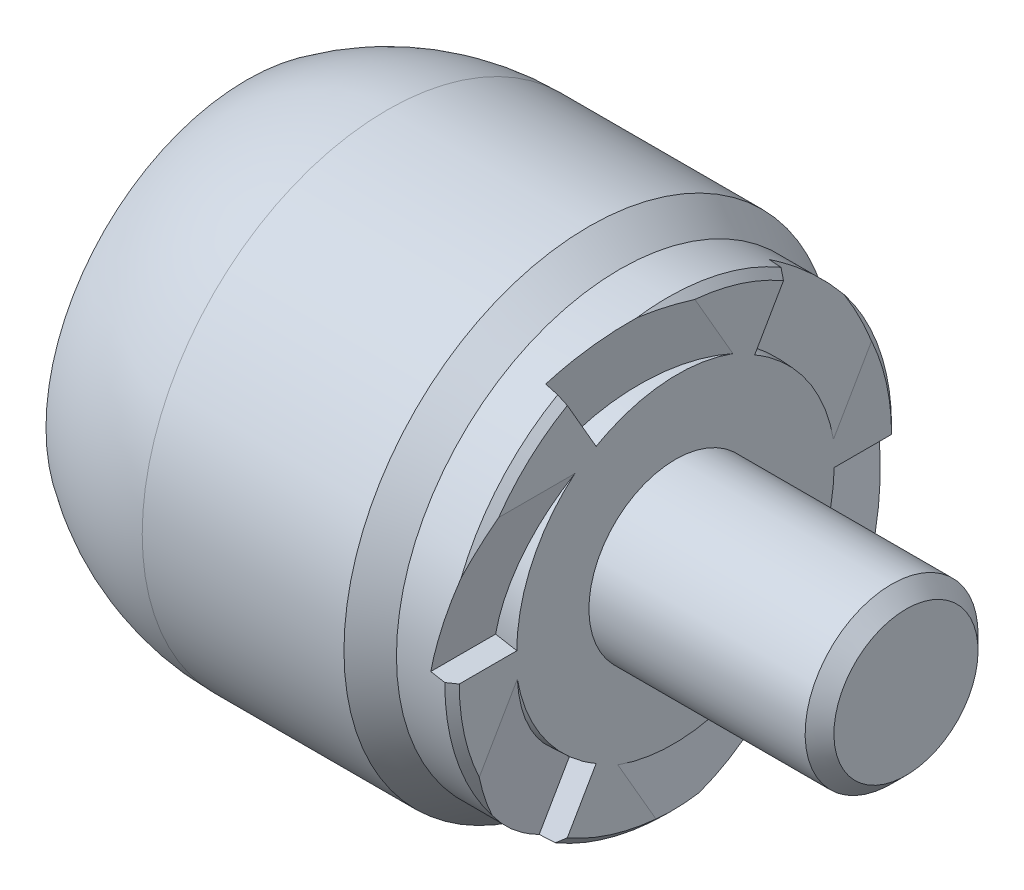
ISO-10303-21;
HEADER;
FILE_DESCRIPTION(('STEP AP214'),'2;1');
FILE_NAME('part.step','',(''),(''),'','','');
FILE_SCHEMA(('AUTOMOTIVE_DESIGN { 1 0 10303 214 1 1 1 1 }'));
ENDSEC;
DATA;
#1=APPLICATION_CONTEXT('core data for automotive mechanical design processes');
#2=APPLICATION_PROTOCOL_DEFINITION('international standard','automotive_design',2000,#1);
#3=PRODUCT_CONTEXT('',#1,'mechanical');
#4=PRODUCT('Part','Part','',(#3));
#5=PRODUCT_RELATED_PRODUCT_CATEGORY('part','',(#4));
#6=PRODUCT_DEFINITION_FORMATION('','',#4);
#7=PRODUCT_DEFINITION_CONTEXT('part definition',#1,'design');
#8=PRODUCT_DEFINITION('design','',#6,#7);
#9=PRODUCT_DEFINITION_SHAPE('','',#8);
#10=(LENGTH_UNIT() NAMED_UNIT(*) SI_UNIT(.MILLI.,.METRE.));
#11=(NAMED_UNIT(*) PLANE_ANGLE_UNIT() SI_UNIT($,.RADIAN.));
#12=(NAMED_UNIT(*) SI_UNIT($,.STERADIAN.) SOLID_ANGLE_UNIT());
#13=UNCERTAINTY_MEASURE_WITH_UNIT(LENGTH_MEASURE(1.E-05),#10,'distance_accuracy_value','');
#14=(GEOMETRIC_REPRESENTATION_CONTEXT(3) GLOBAL_UNCERTAINTY_ASSIGNED_CONTEXT((#13)) GLOBAL_UNIT_ASSIGNED_CONTEXT((#10,
#11,#12)) REPRESENTATION_CONTEXT('',''));
#15=CARTESIAN_POINT('',(0.,0.,0.));
#16=DIRECTION('',(0.,0.,1.));
#17=DIRECTION('',(1.,0.,0.));
#18=AXIS2_PLACEMENT_3D('',#15,#16,#17);
#19=CARTESIAN_POINT('',(20.,15.,0.));
#20=DIRECTION('',(1.,0.,0.));
#21=DIRECTION('',(0.,1.,0.));
#22=AXIS2_PLACEMENT_3D('',#19,#20,#21);
#23=PLANE('',#22);
#24=CARTESIAN_POINT('',(20.,0.,0.));
#25=DIRECTION('',(1.,0.,0.));
#26=DIRECTION('',(0.,1.,0.));
#27=AXIS2_PLACEMENT_3D('',#24,#25,#26);
#28=CIRCLE('',#27,6.);
#29=CARTESIAN_POINT('',(20.,5.99999999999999,0.));
#30=VERTEX_POINT('',#29);
#31=EDGE_CURVE('E384',#30,#30,#28,.T.);
#32=ORIENTED_EDGE('',*,*,#31,.F.);
#33=EDGE_LOOP('',(#32));
#34=FACE_BOUND('',#33,.T.);
#35=CARTESIAN_POINT('',(20.,0.,0.));
#36=DIRECTION('',(1.,0.,0.));
#37=DIRECTION('',(0.,1.,0.));
#38=AXIS2_PLACEMENT_3D('',#35,#36,#37);
#39=CIRCLE('',#38,15.);
#40=CARTESIAN_POINT('',(20.,0.,15.));
#41=VERTEX_POINT('',#40);
#42=CARTESIAN_POINT('',(20.,-6.30103038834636,13.6123846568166));
#43=VERTEX_POINT('',#42);
#44=EDGE_CURVE('E381',#41,#43,#39,.T.);
#45=ORIENTED_EDGE('',*,*,#44,.T.);
#46=DIRECTION('',(0.,0.866025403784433,-0.50000000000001));
#47=VECTOR('',#46,1.);
#48=CARTESIAN_POINT('',(20.,15.5690778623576,0.985671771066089));
#49=LINE('',#48,#47);
#50=CARTESIAN_POINT('',(20.,-1.72030946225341,10.9677041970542));
#51=VERTEX_POINT('',#50);
#52=EDGE_CURVE('E216',#43,#51,#49,.T.);
#53=ORIENTED_EDGE('',*,*,#52,.T.);
#54=CARTESIAN_POINT('',(20.,0.,0.));
#55=DIRECTION('',(1.,0.,0.));
#56=DIRECTION('',(0.,-0.50000000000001,-0.866025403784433));
#57=AXIS2_PLACEMENT_3D('',#54,#55,#56);
#58=ELLIPSE('',#57,11.1696927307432,11.);
#59=CARTESIAN_POINT('',(20.,-9.52627944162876,5.50000000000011));
#60=VERTEX_POINT('',#59);
#61=EDGE_CURVE('E11',#60,#51,#58,.F.);
#62=ORIENTED_EDGE('',*,*,#61,.F.);
#63=DIRECTION('',(0.,0.866025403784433,-0.50000000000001));
#64=VECTOR('',#63,1.);
#65=CARTESIAN_POINT('',(20.,-9.52627944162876,5.50000000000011));
#66=LINE('',#65,#64);
#67=CARTESIAN_POINT('',(20.,-12.9903810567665,7.50000000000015));
#68=VERTEX_POINT('',#67);
#69=EDGE_CURVE('E207',#68,#60,#66,.T.);
#70=ORIENTED_EDGE('',*,*,#69,.F.);
#71=CARTESIAN_POINT('',(20.,-14.9391861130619,1.34933994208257));
#72=VERTEX_POINT('',#71);
#73=EDGE_CURVE('E385',#68,#72,#39,.T.);
#74=ORIENTED_EDGE('',*,*,#73,.T.);
#75=DIRECTION('',(0.,0.866025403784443,0.499999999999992));
#76=VECTOR('',#75,1.);
#77=CARTESIAN_POINT('',(20.,6.93092213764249,13.9760528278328));
#78=LINE('',#77,#76);
#79=CARTESIAN_POINT('',(20.,-10.3584651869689,3.9940204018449));
#80=VERTEX_POINT('',#79);
#81=EDGE_CURVE('E258',#72,#80,#78,.T.);
#82=ORIENTED_EDGE('',*,*,#81,.T.);
#83=CARTESIAN_POINT('',(20.,0.,0.));
#84=DIRECTION('',(1.,0.,0.));
#85=DIRECTION('',(0.,0.499999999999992,-0.866025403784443));
#86=AXIS2_PLACEMENT_3D('',#83,#84,#85);
#87=ELLIPSE('',#86,11.1696927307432,11.);
#88=CARTESIAN_POINT('',(20.,-9.52627944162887,-5.49999999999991));
#89=VERTEX_POINT('',#88);
#90=EDGE_CURVE('E439',#89,#80,#87,.F.);
#91=ORIENTED_EDGE('',*,*,#90,.F.);
#92=DIRECTION('',(0.,0.866025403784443,0.499999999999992));
#93=VECTOR('',#92,1.);
#94=CARTESIAN_POINT('',(20.,-9.52627944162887,-5.49999999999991));
#95=LINE('',#94,#93);
#96=CARTESIAN_POINT('',(20.,-12.9903810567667,-7.49999999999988));
#97=VERTEX_POINT('',#96);
#98=EDGE_CURVE('E591',#97,#89,#95,.T.);
#99=ORIENTED_EDGE('',*,*,#98,.F.);
#100=CARTESIAN_POINT('',(20.,-8.63815572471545,-12.263044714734));
#101=VERTEX_POINT('',#100);
#102=EDGE_CURVE('E576',#97,#101,#39,.T.);
#103=ORIENTED_EDGE('',*,*,#102,.T.);
#104=DIRECTION('',(0.,0.,1.));
#105=VECTOR('',#104,1.);
#106=CARTESIAN_POINT('',(20.,-8.6381557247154,1.65064454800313E-13));
#107=LINE('',#106,#105);
#108=CARTESIAN_POINT('',(20.,-8.63815572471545,-6.97368379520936));
#109=VERTEX_POINT('',#108);
#110=EDGE_CURVE('E272',#101,#109,#107,.T.);
#111=ORIENTED_EDGE('',*,*,#110,.T.);
#112=CARTESIAN_POINT('',(20.,0.,0.));
#113=DIRECTION('',(1.,0.,0.));
#114=DIRECTION('',(0.,1.,0.));
#115=AXIS2_PLACEMENT_3D('',#112,#113,#114);
#116=ELLIPSE('',#115,11.1696927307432,11.);
#117=CARTESIAN_POINT('',(20.,0.,-11.));
#118=VERTEX_POINT('',#117);
#119=EDGE_CURVE('E432',#118,#109,#116,.F.);
#120=ORIENTED_EDGE('',*,*,#119,.F.);
#121=DIRECTION('',(0.,0.,1.));
#122=VECTOR('',#121,1.);
#123=CARTESIAN_POINT('',(20.,0.,-11.));
#124=LINE('',#123,#122);
#125=CARTESIAN_POINT('',(20.,-1.00889892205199E-13,-15.));
#126=VERTEX_POINT('',#125);
#127=EDGE_CURVE('E263',#126,#118,#124,.T.);
#128=ORIENTED_EDGE('',*,*,#127,.F.);
#129=CARTESIAN_POINT('',(20.,6.30103038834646,-13.6123846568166));
#130=VERTEX_POINT('',#129);
#131=EDGE_CURVE('E575',#126,#130,#39,.T.);
#132=ORIENTED_EDGE('',*,*,#131,.T.);
#133=DIRECTION('',(0.,-0.866025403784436,0.500000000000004));
#134=VECTOR('',#133,1.);
#135=CARTESIAN_POINT('',(20.,6.93092213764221,-13.9760528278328));
#136=LINE('',#135,#134);
#137=CARTESIAN_POINT('',(20.,1.72030946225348,-10.9677041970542));
#138=VERTEX_POINT('',#137);
#139=EDGE_CURVE('E313',#130,#138,#136,.T.);
#140=ORIENTED_EDGE('',*,*,#139,.T.);
#141=CARTESIAN_POINT('',(20.,0.,0.));
#142=DIRECTION('',(1.,0.,0.));
#143=DIRECTION('',(0.,0.500000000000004,0.866025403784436));
#144=AXIS2_PLACEMENT_3D('',#141,#142,#143);
#145=ELLIPSE('',#144,11.1696927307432,11.);
#146=CARTESIAN_POINT('',(20.,9.5262794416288,-5.50000000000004));
#147=VERTEX_POINT('',#146);
#148=EDGE_CURVE('E425',#147,#138,#145,.F.);
#149=ORIENTED_EDGE('',*,*,#148,.F.);
#150=DIRECTION('',(0.,-0.866025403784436,0.500000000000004));
#151=VECTOR('',#150,1.);
#152=CARTESIAN_POINT('',(20.,9.5262794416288,-5.50000000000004));
#153=LINE('',#152,#151);
#154=CARTESIAN_POINT('',(20.,12.9903810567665,-7.50000000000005));
#155=VERTEX_POINT('',#154);
#156=EDGE_CURVE('E574',#155,#147,#153,.T.);
#157=ORIENTED_EDGE('',*,*,#156,.F.);
#158=CARTESIAN_POINT('',(20.,14.9391861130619,-1.34933994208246));
#159=VERTEX_POINT('',#158);
#160=EDGE_CURVE('E563',#155,#159,#39,.T.);
#161=ORIENTED_EDGE('',*,*,#160,.T.);
#162=DIRECTION('',(0.,-0.86602540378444,-0.499999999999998));
#163=VECTOR('',#162,1.);
#164=CARTESIAN_POINT('',(20.,15.5690778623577,-0.985671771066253));
#165=LINE('',#164,#163);
#166=CARTESIAN_POINT('',(20.,10.3584651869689,-3.99402040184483));
#167=VERTEX_POINT('',#166);
#168=EDGE_CURVE('E327',#159,#167,#165,.T.);
#169=ORIENTED_EDGE('',*,*,#168,.T.);
#170=CARTESIAN_POINT('',(20.,0.,0.));
#171=DIRECTION('',(1.,0.,0.));
#172=DIRECTION('',(0.,-0.499999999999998,0.86602540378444));
#173=AXIS2_PLACEMENT_3D('',#170,#171,#172);
#174=ELLIPSE('',#173,11.1696927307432,11.);
#175=CARTESIAN_POINT('',(20.,9.52627944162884,5.49999999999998));
#176=VERTEX_POINT('',#175);
#177=EDGE_CURVE('E418',#176,#167,#174,.F.);
#178=ORIENTED_EDGE('',*,*,#177,.F.);
#179=DIRECTION('',(0.,-0.86602540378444,-0.499999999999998));
#180=VECTOR('',#179,1.);
#181=CARTESIAN_POINT('',(20.,9.52627944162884,5.49999999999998));
#182=LINE('',#181,#180);
#183=CARTESIAN_POINT('',(20.,12.9903810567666,7.49999999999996));
#184=VERTEX_POINT('',#183);
#185=EDGE_CURVE('E312',#184,#176,#182,.T.);
#186=ORIENTED_EDGE('',*,*,#185,.F.);
#187=CARTESIAN_POINT('',(20.,8.63815572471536,12.2630447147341));
#188=VERTEX_POINT('',#187);
#189=EDGE_CURVE('E380',#184,#188,#39,.T.);
#190=ORIENTED_EDGE('',*,*,#189,.T.);
#191=DIRECTION('',(0.,0.,-1.));
#192=VECTOR('',#191,1.);
#193=CARTESIAN_POINT('',(20.,8.6381557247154,0.));
#194=LINE('',#193,#192);
#195=CARTESIAN_POINT('',(20.,8.63815572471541,6.97368379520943));
#196=VERTEX_POINT('',#195);
#197=EDGE_CURVE('E366',#188,#196,#194,.T.);
#198=ORIENTED_EDGE('',*,*,#197,.T.);
#199=CARTESIAN_POINT('',(20.,0.,0.));
#200=DIRECTION('',(1.,0.,0.));
#201=DIRECTION('',(0.,-1.,0.));
#202=AXIS2_PLACEMENT_3D('',#199,#200,#201);
#203=ELLIPSE('',#202,11.1696927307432,11.);
#204=CARTESIAN_POINT('',(20.,0.,11.));
#205=VERTEX_POINT('',#204);
#206=EDGE_CURVE('E411',#205,#196,#203,.F.);
#207=ORIENTED_EDGE('',*,*,#206,.F.);
#208=DIRECTION('',(0.,0.,-1.));
#209=VECTOR('',#208,1.);
#210=CARTESIAN_POINT('',(20.,0.,11.));
#211=LINE('',#210,#209);
#212=EDGE_CURVE('E336',#41,#205,#211,.T.);
#213=ORIENTED_EDGE('',*,*,#212,.F.);
#214=EDGE_LOOP('',(#45,#53,#62,#70,#74,#82,#91,#99,#103,#111,#120,#128,#132,#140,#149,#157,#161,
#169,#178,#186,#190,#198,#207,#213));
#215=FACE_BOUND('',#214,.T.);
#216=ADVANCED_FACE('F29',(#34,#215),#23,.T.);
#217=CARTESIAN_POINT('',(20.,0.,0.));
#218=DIRECTION('',(-1.,0.,0.));
#219=DIRECTION('',(0.,-1.,0.));
#220=AXIS2_PLACEMENT_3D('',#217,#218,#219);
#221=CONICAL_SURFACE('',#220,15.,0.785398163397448);
#222=CARTESIAN_POINT('',(19.5,0.,0.));
#223=DIRECTION('',(1.,0.,0.));
#224=DIRECTION('',(0.,1.,0.));
#225=AXIS2_PLACEMENT_3D('',#222,#223,#224);
#226=CIRCLE('',#225,15.5);
#227=CARTESIAN_POINT('',(19.5,0.0881634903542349,15.4997492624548));
#228=VERTEX_POINT('',#227);
#229=CARTESIAN_POINT('',(19.5,-9.54605621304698,12.2115851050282));
#230=VERTEX_POINT('',#229);
#231=EDGE_CURVE('E377',#228,#230,#226,.T.);
#232=ORIENTED_EDGE('',*,*,#231,.T.);
#233=CARTESIAN_POINT('',(17.9466509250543,-1.50348277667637,-2.60410855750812));
#234=DIRECTION('',(0.984807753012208,-0.086824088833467,-0.150383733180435));
#235=DIRECTION('',(-0.173648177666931,-0.492403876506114,-0.852868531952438));
#236=AXIS2_PLACEMENT_3D('',#233,#234,#235);
#237=ELLIPSE('',#236,17.316424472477,16.7861512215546);
#238=EDGE_CURVE('E44',#230,#43,#237,.F.);
#239=ORIENTED_EDGE('',*,*,#238,.T.);
#240=ORIENTED_EDGE('',*,*,#44,.F.);
#241=CARTESIAN_POINT('',(19.4998,0.0881987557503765,15.499949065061));
#242=CARTESIAN_POINT('',(19.5832202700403,0.0734895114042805,15.4166117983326));
#243=CARTESIAN_POINT('',(19.6666304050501,0.0587820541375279,15.3332640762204));
#244=CARTESIAN_POINT('',(19.8334304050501,0.0293707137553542,15.1665477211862));
#245=CARTESIAN_POINT('',(19.9168202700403,0.0146668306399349,15.0831790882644));
#246=CARTESIAN_POINT('',(20.0002,-3.52653961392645E-05,14.9997999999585));
#247=B_SPLINE_CURVE_WITH_KNOTS('',3,(#241,#242,#243,#244,#245,#246),.UNSPECIFIED.,.F.,.F.,(4,2,
4),(0.,0.356487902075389,0.712975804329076),.UNSPECIFIED.);
#248=EDGE_CURVE('E359',#228,#41,#247,.T.);
#249=ORIENTED_EDGE('',*,*,#248,.F.);
#250=EDGE_LOOP('',(#232,#239,#240,#249));
#251=FACE_BOUND('',#250,.T.);
#252=ADVANCED_FACE('F484',(#251),#221,.T.);
#253=CARTESIAN_POINT('',(15.0433821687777,-16.8293635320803,10.72562904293));
#254=CARTESIAN_POINT('',(15.4152123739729,-16.5423096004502,10.4841919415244));
#255=CARTESIAN_POINT('',(15.7869540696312,-16.2551683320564,10.2427224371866));
#256=CARTESIAN_POINT('',(16.530223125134,-15.6806741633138,9.75970488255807));
#257=CARTESIAN_POINT('',(16.9017504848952,-15.3933212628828,9.51815683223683));
#258=CARTESIAN_POINT('',(18.0159544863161,-14.5308901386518,8.79337464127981));
#259=CARTESIAN_POINT('',(18.7582532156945,-13.9554393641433,8.31000235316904));
#260=CARTESIAN_POINT('',(19.6666396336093,-13.2496142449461,7.71754214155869));
#261=CARTESIAN_POINT('',(19.833441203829,-13.1199408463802,7.60871355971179));
#262=CARTESIAN_POINT('',(20.0431105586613,-12.9568469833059,7.47186157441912));
#263=CARTESIAN_POINT('',(20.0860182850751,-12.9234657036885,7.44385266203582));
#264=CARTESIAN_POINT('',(20.5518805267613,-12.5609801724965,7.13971972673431));
#265=CARTESIAN_POINT('',(20.9745590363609,-12.2316050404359,6.86349550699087));
#266=CARTESIAN_POINT('',(21.8191891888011,-11.5721441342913,6.31078477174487));
#267=CARTESIAN_POINT('',(22.2411408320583,-11.242058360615,6.03429825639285));
#268=CARTESIAN_POINT('',(23.0840784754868,-10.5809403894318,5.48097541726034));
#269=CARTESIAN_POINT('',(23.5050644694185,-10.2499081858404,5.20413909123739));
#270=CARTESIAN_POINT('',(24.1355400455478,-9.75238554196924,4.78852636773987));
#271=CARTESIAN_POINT('',(24.345531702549,-9.58638197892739,4.64992884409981));
#272=CARTESIAN_POINT('',(24.7651110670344,-9.25398404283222,4.372590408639));
#273=CARTESIAN_POINT('',(24.9746987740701,-9.08758966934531,4.23384949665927));
#274=CARTESIAN_POINT('',(25.1840496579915,-8.92096696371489,4.09502497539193));
#275=B_SPLINE_CURVE_WITH_KNOTS('',3,(#253,#254,#255,#256,#257,#258,#259,#260,#261,#262,#263,
#264,#265,#266,#267,#268,#269,#270,#271,#272,#273,#274),.UNSPECIFIED.,.F.,.F.,(4,2,2,2,2,2,2,2,
2,2,4),(0.,1.58447010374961,3.1689408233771,6.33788155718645,7.05085735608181,7.23432108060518,
9.04291206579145,10.8515020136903,12.6601036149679,13.5644075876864,14.4687125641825),.UNSPECIFIED.);
#276=CARTESIAN_POINT('',(19.5,-13.3790948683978,7.82622645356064));
#277=VERTEX_POINT('',#276);
#278=EDGE_CURVE('E218',#277,#68,#275,.T.);
#279=ORIENTED_EDGE('',*,*,#278,.F.);
#280=CARTESIAN_POINT('',(19.5,-15.3485710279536,-2.16133463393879));
#281=VERTEX_POINT('',#280);
#282=EDGE_CURVE('E52',#277,#281,#226,.T.);
#283=ORIENTED_EDGE('',*,*,#282,.T.);
#284=CARTESIAN_POINT('',(17.9466509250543,1.5034827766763,-2.60410855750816));
#285=DIRECTION('',(0.984807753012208,0.0868240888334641,-0.150383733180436));
#286=DIRECTION('',(-0.173648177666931,0.492403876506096,-0.852868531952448));
#287=AXIS2_PLACEMENT_3D('',#284,#285,#286);
#288=ELLIPSE('',#287,17.316424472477,16.7861512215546);
#289=EDGE_CURVE('E589',#281,#72,#288,.F.);
#290=ORIENTED_EDGE('',*,*,#289,.T.);
#291=ORIENTED_EDGE('',*,*,#73,.F.);
#292=EDGE_LOOP('',(#279,#283,#290,#291));
#293=FACE_BOUND('',#292,.T.);
#294=ADVANCED_FACE('F443',(#293),#221,.T.);
#295=CARTESIAN_POINT('',(19.4998,-13.4674490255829,-7.67359216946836));
#296=CARTESIAN_POINT('',(19.5832202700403,-13.3879222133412,-7.64466211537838));
#297=CARTESIAN_POINT('',(19.6666304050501,-13.308387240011,-7.61572528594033));
#298=CARTESIAN_POINT('',(19.8334304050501,-13.149300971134,-7.55783807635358));
#299=CARTESIAN_POINT('',(19.9168202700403,-13.0697496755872,-7.52888769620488));
#300=CARTESIAN_POINT('',(20.0002,-12.9901902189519,-7.4999305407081));
#301=B_SPLINE_CURVE_WITH_KNOTS('',3,(#295,#296,#297,#298,#299,#300),.UNSPECIFIED.,.F.,.F.,(4,2,
4),(0.,0.356487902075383,0.712975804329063),.UNSPECIFIED.);
#302=CARTESIAN_POINT('',(19.5,-13.4672583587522,-7.67352280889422));
#303=VERTEX_POINT('',#302);
#304=EDGE_CURVE('E251',#303,#97,#301,.T.);
#305=ORIENTED_EDGE('',*,*,#304,.F.);
#306=CARTESIAN_POINT('',(19.5,-5.80251481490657,-14.3729197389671));
#307=VERTEX_POINT('',#306);
#308=EDGE_CURVE('E447',#303,#307,#226,.T.);
#309=ORIENTED_EDGE('',*,*,#308,.T.);
#310=CARTESIAN_POINT('',(17.9466509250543,3.00696555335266,0.));
#311=DIRECTION('',(0.984807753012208,0.173648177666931,0.));
#312=DIRECTION('',(-0.173648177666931,0.984807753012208,0.));
#313=AXIS2_PLACEMENT_3D('',#310,#311,#312);
#314=ELLIPSE('',#313,17.316424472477,16.7861512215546);
#315=EDGE_CURVE('E269',#307,#101,#314,.F.);
#316=ORIENTED_EDGE('',*,*,#315,.T.);
#317=ORIENTED_EDGE('',*,*,#102,.F.);
#318=EDGE_LOOP('',(#305,#309,#316,#317));
#319=FACE_BOUND('',#318,.T.);
#320=ADVANCED_FACE('F561',(#319),#221,.T.);
#321=CARTESIAN_POINT('',(19.4998,-0.08819875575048,-15.499949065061));
#322=CARTESIAN_POINT('',(19.5832202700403,-0.0734895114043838,-15.4166117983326));
#323=CARTESIAN_POINT('',(19.6666304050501,-0.0587820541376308,-15.3332640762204));
#324=CARTESIAN_POINT('',(19.8334304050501,-0.0293707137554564,-15.1665477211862));
#325=CARTESIAN_POINT('',(19.9168202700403,-0.0146668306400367,-15.0831790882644));
#326=CARTESIAN_POINT('',(20.0002,3.5265396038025E-05,-14.9997999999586));
#327=B_SPLINE_CURVE_WITH_KNOTS('',3,(#321,#322,#323,#324,#325,#326),.UNSPECIFIED.,.F.,.F.,(4,2,
4),(0.,0.356487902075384,0.712975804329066),.UNSPECIFIED.);
#328=CARTESIAN_POINT('',(19.5,-0.0881634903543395,-15.4997492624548));
#329=VERTEX_POINT('',#328);
#330=EDGE_CURVE('E275',#329,#126,#327,.T.);
#331=ORIENTED_EDGE('',*,*,#330,.F.);
#332=CARTESIAN_POINT('',(19.5,9.54605621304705,-12.2115851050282));
#333=VERTEX_POINT('',#332);
#334=EDGE_CURVE('E448',#329,#333,#226,.T.);
#335=ORIENTED_EDGE('',*,*,#334,.T.);
#336=CARTESIAN_POINT('',(17.9466509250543,1.50348277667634,2.60410855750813));
#337=DIRECTION('',(0.984807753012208,0.0868240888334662,0.150383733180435));
#338=DIRECTION('',(-0.173648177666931,0.492403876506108,0.852868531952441));
#339=AXIS2_PLACEMENT_3D('',#336,#337,#338);
#340=ELLIPSE('',#339,17.316424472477,16.7861512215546);
#341=EDGE_CURVE('E601',#333,#130,#340,.F.);
#342=ORIENTED_EDGE('',*,*,#341,.T.);
#343=ORIENTED_EDGE('',*,*,#131,.F.);
#344=EDGE_LOOP('',(#331,#335,#342,#343));
#345=FACE_BOUND('',#344,.T.);
#346=ADVANCED_FACE('F557',(#345),#221,.T.);
#347=CARTESIAN_POINT('',(15.0433822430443,16.8293634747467,-10.7256289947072));
#348=CARTESIAN_POINT('',(15.4152124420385,16.5423095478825,-10.4841918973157));
#349=CARTESIAN_POINT('',(15.786954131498,16.2551682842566,-10.2427223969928));
#350=CARTESIAN_POINT('',(16.5302231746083,15.6806741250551,-9.75970485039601));
#351=CARTESIAN_POINT('',(16.9017505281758,15.3933212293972,-9.51815680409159));
#352=CARTESIAN_POINT('',(18.0159545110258,14.5308901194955,-8.79337462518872));
#353=CARTESIAN_POINT('',(18.7582532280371,13.955439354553,-8.31000234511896));
#354=CARTESIAN_POINT('',(19.6666396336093,13.2496142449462,-7.71754214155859));
#355=CARTESIAN_POINT('',(19.833441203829,13.1199408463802,-7.60871355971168));
#356=CARTESIAN_POINT('',(20.0431105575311,12.9568469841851,-7.4718615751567));
#357=CARTESIAN_POINT('',(20.0860182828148,12.923465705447,-7.44385266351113));
#358=CARTESIAN_POINT('',(20.5518805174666,12.5609801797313,-7.13971973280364));
#359=CARTESIAN_POINT('',(20.9745590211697,12.2316050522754,-6.86349551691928));
#360=CARTESIAN_POINT('',(21.8191891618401,11.572144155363,-6.31078478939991));
#361=CARTESIAN_POINT('',(22.2411407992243,11.2420583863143,-6.03429827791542));
#362=CARTESIAN_POINT('',(23.0840784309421,10.5809404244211,-5.48097544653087));
#363=CARTESIAN_POINT('',(23.5050644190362,10.2499082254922,-5.20413912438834));
#364=CARTESIAN_POINT('',(24.135539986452,9.75238558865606,-4.78852640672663));
#365=CARTESIAN_POINT('',(24.3455316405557,9.58638202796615,-4.64992888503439));
#366=CARTESIAN_POINT('',(24.7651109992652,9.25398409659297,-4.37259045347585));
#367=CARTESIAN_POINT('',(24.9746987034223,9.08758972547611,-4.23384954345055));
#368=CARTESIAN_POINT('',(25.1840495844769,8.92096702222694,-4.09502502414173));
#369=B_SPLINE_CURVE_WITH_KNOTS('',3,(#347,#348,#349,#350,#351,#352,#353,#354,#355,#356,#357,
#358,#359,#360,#361,#362,#363,#364,#365,#366,#367,#368),.UNSPECIFIED.,.F.,.F.,(4,2,2,2,2,2,2,2,
2,2,4),(0.,1.58447007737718,3.16894077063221,6.33788145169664,7.05085725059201,7.23432097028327,
9.04291193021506,10.8515018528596,12.660103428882,13.5644073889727,14.468712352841),.UNSPECIFIED.);
#370=CARTESIAN_POINT('',(19.5,13.3790948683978,-7.82622645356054));
#371=VERTEX_POINT('',#370);
#372=EDGE_CURVE('E306',#371,#155,#369,.T.);
#373=ORIENTED_EDGE('',*,*,#372,.F.);
#374=CARTESIAN_POINT('',(19.5,15.3485710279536,2.16133463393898));
#375=VERTEX_POINT('',#374);
#376=EDGE_CURVE('E453',#371,#375,#226,.T.);
#377=ORIENTED_EDGE('',*,*,#376,.T.);
#378=CARTESIAN_POINT('',(17.9466509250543,-1.50348277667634,2.60410855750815));
#379=DIRECTION('',(0.984807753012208,-0.0868240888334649,0.150383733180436));
#380=DIRECTION('',(-0.173648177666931,-0.492403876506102,0.852868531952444));
#381=AXIS2_PLACEMENT_3D('',#378,#379,#380);
#382=ELLIPSE('',#381,17.316424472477,16.7861512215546);
#383=EDGE_CURVE('E324',#375,#159,#382,.F.);
#384=ORIENTED_EDGE('',*,*,#383,.T.);
#385=ORIENTED_EDGE('',*,*,#160,.F.);
#386=EDGE_LOOP('',(#373,#377,#384,#385));
#387=FACE_BOUND('',#386,.T.);
#388=ADVANCED_FACE('F536',(#387),#221,.T.);
#389=CARTESIAN_POINT('',(0.,0.,0.));
#390=DIRECTION('',(1.,0.,0.));
#391=DIRECTION('',(0.,1.,0.));
#392=AXIS2_PLACEMENT_3D('',#389,#390,#391);
#393=SPHERICAL_SURFACE('',#392,17.);
#394=CARTESIAN_POINT('',(-9.75079941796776,0.,0.));
#395=DIRECTION('',(1.,0.,0.));
#396=DIRECTION('',(0.,1.,0.));
#397=AXIS2_PLACEMENT_3D('',#394,#395,#396);
#398=CIRCLE('',#397,13.9255847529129);
#399=CARTESIAN_POINT('',(-9.75079941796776,13.9255847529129,0.));
#400=VERTEX_POINT('',#399);
#401=EDGE_CURVE('E403',#400,#400,#398,.T.);
#402=ORIENTED_EDGE('',*,*,#401,.T.);
#403=EDGE_LOOP('',(#402));
#404=FACE_BOUND('',#403,.T.);
#405=CARTESIAN_POINT('',(0.,0.,0.));
#406=DIRECTION('',(1.,0.,0.));
#407=DIRECTION('',(0.,1.,0.));
#408=AXIS2_PLACEMENT_3D('',#405,#406,#407);
#409=CIRCLE('',#408,17.);
#410=CARTESIAN_POINT('',(0.,17.,0.));
#411=VERTEX_POINT('',#410);
#412=EDGE_CURVE('E365',#411,#411,#409,.T.);
#413=ORIENTED_EDGE('',*,*,#412,.F.);
#414=EDGE_LOOP('',(#413));
#415=FACE_BOUND('',#414,.T.);
#416=ADVANCED_FACE('F31',(#404,#415),#393,.T.);
#417=CARTESIAN_POINT('',(-9.75079941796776,0.,0.));
#418=DIRECTION('',(-1.,0.,0.));
#419=DIRECTION('',(0.,-1.,0.));
#420=AXIS2_PLACEMENT_3D('',#417,#418,#419);
#421=CONICAL_SURFACE('',#420,13.9255847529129,0.959931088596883);
#422=CARTESIAN_POINT('',(-6.88291723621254,0.,0.));
#423=DIRECTION('',(1.,0.,0.));
#424=DIRECTION('',(0.,1.,0.));
#425=AXIS2_PLACEMENT_3D('',#422,#423,#424);
#426=CIRCLE('',#425,9.82982453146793);
#427=CARTESIAN_POINT('',(-6.88291723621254,9.82982453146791,0.));
#428=VERTEX_POINT('',#427);
#429=EDGE_CURVE('E400',#428,#428,#426,.T.);
#430=ORIENTED_EDGE('',*,*,#429,.T.);
#431=EDGE_LOOP('',(#430));
#432=FACE_BOUND('',#431,.T.);
#433=ORIENTED_EDGE('',*,*,#401,.F.);
#434=EDGE_LOOP('',(#433));
#435=FACE_BOUND('',#434,.T.);
#436=ADVANCED_FACE('F529',(#432,#435),#421,.F.);
#437=CARTESIAN_POINT('',(0.,0.,0.));
#438=DIRECTION('',(1.,0.,0.));
#439=DIRECTION('',(0.,1.,0.));
#440=AXIS2_PLACEMENT_3D('',#437,#438,#439);
#441=SPHERICAL_SURFACE('',#440,12.);
#442=CARTESIAN_POINT('',(9.74679434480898,0.,0.));
#443=DIRECTION('',(1.,0.,0.));
#444=DIRECTION('',(0.,1.,0.));
#445=AXIS2_PLACEMENT_3D('',#442,#443,#444);
#446=CIRCLE('',#445,7.);
#447=CARTESIAN_POINT('',(9.74679434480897,6.99999999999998,0.));
#448=VERTEX_POINT('',#447);
#449=EDGE_CURVE('E397',#448,#448,#446,.T.);
#450=CARTESIAN_POINT('',(9.74679434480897,6.99999999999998,0.));
#451=CARTESIAN_POINT('',(9.63313246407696,7.1582696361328,0.));
#452=CARTESIAN_POINT('',(9.51560945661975,7.31376584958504,0.));
#453=CARTESIAN_POINT('',(9.2731339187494,7.61885355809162,0.));
#454=CARTESIAN_POINT('',(9.14818138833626,7.76844505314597,0.));
#455=CARTESIAN_POINT('',(8.89113953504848,8.06136545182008,0.));
#456=CARTESIAN_POINT('',(8.75905021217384,8.20469435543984,0.));
#457=CARTESIAN_POINT('',(8.48804915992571,8.48475031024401,0.));
#458=CARTESIAN_POINT('',(8.34913743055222,8.62147736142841,0.));
#459=CARTESIAN_POINT('',(8.06482087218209,8.88800500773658,0.));
#460=CARTESIAN_POINT('',(7.91941604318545,9.01780560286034,0.));
#461=CARTESIAN_POINT('',(7.62245833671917,9.27017243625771,0.));
#462=CARTESIAN_POINT('',(7.47090545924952,9.39273867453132,0.));
#463=CARTESIAN_POINT('',(7.16201120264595,9.63034598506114,0.));
#464=CARTESIAN_POINT('',(7.00466982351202,9.74538705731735,0.));
#465=CARTESIAN_POINT('',(6.68457186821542,9.96767109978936,0.));
#466=CARTESIAN_POINT('',(6.52181529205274,10.0749140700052,0.));
#467=CARTESIAN_POINT('',(6.19127308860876,10.281347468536,0.));
#468=CARTESIAN_POINT('',(6.02348746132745,10.380537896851,0.));
#469=CARTESIAN_POINT('',(5.68328523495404,10.5706308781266,0.));
#470=CARTESIAN_POINT('',(5.51086863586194,10.6615334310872,0.));
#471=CARTESIAN_POINT('',(5.16181353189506,10.8348349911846,0.));
#472=CARTESIAN_POINT('',(4.98517502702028,10.9172339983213,0.));
#473=CARTESIAN_POINT('',(4.6280951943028,11.073332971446,0.));
#474=CARTESIAN_POINT('',(4.4476538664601,11.1470329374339,0.));
#475=CARTESIAN_POINT('',(4.08339649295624,11.2855589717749,0.));
#476=CARTESIAN_POINT('',(3.89958044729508,11.350385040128,0.));
#477=CARTESIAN_POINT('',(3.52900974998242,11.4710094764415,0.));
#478=CARTESIAN_POINT('',(3.34225509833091,11.5268078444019,0.));
#479=CARTESIAN_POINT('',(2.96625027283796,11.6292444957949,0.));
#480=CARTESIAN_POINT('',(2.77700009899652,11.6758827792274,0.));
#481=CARTESIAN_POINT('',(2.39645323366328,11.7598886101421,0.));
#482=CARTESIAN_POINT('',(2.20515654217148,11.7972561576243,0.));
#483=CARTESIAN_POINT('',(1.82097050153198,11.8626318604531,0.));
#484=CARTESIAN_POINT('',(1.62808115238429,11.8906400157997,0.));
#485=CARTESIAN_POINT('',(1.24116743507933,11.9372304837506,0.));
#486=CARTESIAN_POINT('',(1.04714306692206,11.9558127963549,0.));
#487=CARTESIAN_POINT('',(0.658419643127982,11.9835074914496,0.));
#488=CARTESIAN_POINT('',(0.463720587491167,11.99261987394,0.));
#489=CARTESIAN_POINT('',(0.0741097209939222,12.0013530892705,0.));
#490=CARTESIAN_POINT('',(-0.120802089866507,12.0009739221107,0.));
#491=CARTESIAN_POINT('',(-0.510376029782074,11.9907249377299,0.));
#492=CARTESIAN_POINT('',(-0.705038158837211,11.980855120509,0.));
#493=CARTESIAN_POINT('',(-1.09365089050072,11.9516482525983,0.));
#494=CARTESIAN_POINT('',(-1.2876014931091,11.9323112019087,0.));
#495=CARTESIAN_POINT('',(-1.67433101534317,11.8842157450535,0.));
#496=CARTESIAN_POINT('',(-1.86710993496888,11.8554573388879,0.));
#497=CARTESIAN_POINT('',(-2.25103871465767,11.7885874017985,0.));
#498=CARTESIAN_POINT('',(-2.44218857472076,11.7504758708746,0.));
#499=CARTESIAN_POINT('',(-2.82240572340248,11.6649901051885,0.));
#500=CARTESIAN_POINT('',(-3.01147301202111,11.6176158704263,0.));
#501=CARTESIAN_POINT('',(-3.3870764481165,11.5137170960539,0.));
#502=CARTESIAN_POINT('',(-3.57361259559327,11.4571925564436,0.));
#503=CARTESIAN_POINT('',(-3.943711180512,11.3351272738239,0.));
#504=CARTESIAN_POINT('',(-4.12727361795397,11.2695865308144,0.));
#505=CARTESIAN_POINT('',(-4.49098928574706,11.1296443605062,0.));
#506=CARTESIAN_POINT('',(-4.67114251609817,11.0552429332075,0.));
#507=CARTESIAN_POINT('',(-5.02761229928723,10.8977558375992,0.));
#508=CARTESIAN_POINT('',(-5.20392885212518,10.8146701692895,0.));
#509=CARTESIAN_POINT('',(-5.552307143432,10.6400120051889,0.));
#510=CARTESIAN_POINT('',(-5.72436888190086,10.5484395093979,0.));
#511=CARTESIAN_POINT('',(-6.06382864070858,10.3570238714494,0.));
#512=CARTESIAN_POINT('',(-6.23122666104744,10.2571807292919,0.));
#513=CARTESIAN_POINT('',(-6.56096436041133,10.0494647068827,0.));
#514=CARTESIAN_POINT('',(-6.72330403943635,9.94159182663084,0.));
#515=CARTESIAN_POINT('',(-6.88291723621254,9.82982453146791,0.));
#516=B_SPLINE_CURVE_WITH_KNOTS('',3,(#450,#451,#452,#453,#454,#455,#456,#457,#458,#459,#460,
#461,#462,#463,#464,#465,#466,#467,#468,#469,#470,#471,#472,#473,#474,#475,#476,#477,#478,#479,
#480,#481,#482,#483,#484,#485,#486,#487,#488,#489,#490,#491,#492,#493,#494,#495,#496,#497,#498,
#499,#500,#501,#502,#503,#504,#505,#506,#507,#508,#509,#510,#511,#512,#513,#514,#515),
.UNSPECIFIED.,.F.,.F.,(4,2,2,2,2,2,2,2,2,2,2,2,2,2,2,2,2,2,2,2,2,2,2,2,2,2,2,2,2,2,2,2,4),(0.,
0.584505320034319,1.16901064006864,1.75351596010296,2.33802128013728,2.9225266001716,
3.50703192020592,4.09153724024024,4.67604256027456,5.26054788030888,5.8450532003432,
6.42955852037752,7.01406384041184,7.59856916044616,8.18307448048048,8.7675798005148,
9.35208512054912,9.93659044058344,10.5210957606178,11.1056010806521,11.6901064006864,
12.2746117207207,12.859117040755,13.4436223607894,14.0281276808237,14.612633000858,
15.1971383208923,15.7816436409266,16.366148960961,16.9506542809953,17.5351596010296,
18.1196649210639,18.7041702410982),.UNSPECIFIED.);
#517=EDGE_CURVE('BSEAM526',#448,#428,#516,.T.);
#518=ORIENTED_EDGE('',*,*,#449,.T.);
#519=ORIENTED_EDGE('',*,*,#429,.F.);
#520=ORIENTED_EDGE('',*,*,#517,.T.);
#521=ORIENTED_EDGE('',*,*,#517,.F.);
#522=EDGE_LOOP('',(#518,#520,#519,#521));
#523=FACE_BOUND('',#522,.T.);
#524=ADVANCED_FACE('F526',(#523),#441,.F.);
#525=CARTESIAN_POINT('',(94.3833483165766,0.,0.));
#526=DIRECTION('',(1.,0.,0.));
#527=DIRECTION('',(0.,1.,0.));
#528=AXIS2_PLACEMENT_3D('',#525,#526,#527);
#529=CYLINDRICAL_SURFACE('',#528,7.);
#530=CARTESIAN_POINT('',(11.9585481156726,0.,0.));
#531=DIRECTION('',(1.,0.,0.));
#532=DIRECTION('',(0.,1.,0.));
#533=AXIS2_PLACEMENT_3D('',#530,#531,#532);
#534=CIRCLE('',#533,7.);
#535=CARTESIAN_POINT('',(11.9585481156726,6.99999999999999,0.));
#536=VERTEX_POINT('',#535);
#537=EDGE_CURVE('E394',#536,#536,#534,.T.);
#538=ORIENTED_EDGE('',*,*,#537,.T.);
#539=EDGE_LOOP('',(#538));
#540=FACE_BOUND('',#539,.T.);
#541=ORIENTED_EDGE('',*,*,#449,.F.);
#542=EDGE_LOOP('',(#541));
#543=FACE_BOUND('',#542,.T.);
#544=ADVANCED_FACE('F522',(#540,#543),#529,.F.);
#545=CARTESIAN_POINT('',(11.9585481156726,0.,0.));
#546=DIRECTION('',(-1.,0.,0.));
#547=DIRECTION('',(0.,-1.,0.));
#548=AXIS2_PLACEMENT_3D('',#545,#546,#547);
#549=CONICAL_SURFACE('',#548,7.,1.0471975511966);
#550=CARTESIAN_POINT('',(16.,0.,0.));
#551=VERTEX_POINT('',#550);
#552=VERTEX_LOOP('',#551);
#553=FACE_BOUND('',#552,.T.);
#554=ORIENTED_EDGE('',*,*,#537,.F.);
#555=EDGE_LOOP('',(#554));
#556=FACE_BOUND('',#555,.T.);
#557=ADVANCED_FACE('F518',(#553,#556),#549,.F.);
#558=CARTESIAN_POINT('',(36.,5.,0.));
#559=DIRECTION('',(1.,0.,0.));
#560=DIRECTION('',(0.,1.,0.));
#561=AXIS2_PLACEMENT_3D('',#558,#559,#560);
#562=PLANE('',#561);
#563=CARTESIAN_POINT('',(36.,0.,0.));
#564=DIRECTION('',(1.,0.,0.));
#565=DIRECTION('',(0.,1.,0.));
#566=AXIS2_PLACEMENT_3D('',#563,#564,#565);
#567=CIRCLE('',#566,5.00000000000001);
#568=CARTESIAN_POINT('',(36.,5.,0.));
#569=VERTEX_POINT('',#568);
#570=EDGE_CURVE('E391',#569,#569,#567,.T.);
#571=ORIENTED_EDGE('',*,*,#570,.T.);
#572=EDGE_LOOP('',(#571));
#573=FACE_BOUND('',#572,.T.);
#574=ADVANCED_FACE('F514',(#573),#562,.T.);
#575=CARTESIAN_POINT('',(36.,0.,0.));
#576=DIRECTION('',(-1.,0.,0.));
#577=DIRECTION('',(0.,-1.,0.));
#578=AXIS2_PLACEMENT_3D('',#575,#576,#577);
#579=CONICAL_SURFACE('',#578,5.00000000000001,0.785398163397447);
#580=CARTESIAN_POINT('',(35.,0.,0.));
#581=DIRECTION('',(1.,0.,0.));
#582=DIRECTION('',(0.,1.,0.));
#583=AXIS2_PLACEMENT_3D('',#580,#581,#582);
#584=CIRCLE('',#583,6.);
#585=CARTESIAN_POINT('',(35.,5.99999999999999,0.));
#586=VERTEX_POINT('',#585);
#587=EDGE_CURVE('E388',#586,#586,#584,.T.);
#588=ORIENTED_EDGE('',*,*,#587,.T.);
#589=EDGE_LOOP('',(#588));
#590=FACE_BOUND('',#589,.T.);
#591=ORIENTED_EDGE('',*,*,#570,.F.);
#592=EDGE_LOOP('',(#591));
#593=FACE_BOUND('',#592,.T.);
#594=ADVANCED_FACE('F510',(#590,#593),#579,.T.);
#595=CARTESIAN_POINT('',(94.3833483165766,0.,0.));
#596=DIRECTION('',(1.,0.,0.));
#597=DIRECTION('',(0.,1.,0.));
#598=AXIS2_PLACEMENT_3D('',#595,#596,#597);
#599=CYLINDRICAL_SURFACE('',#598,6.);
#600=ORIENTED_EDGE('',*,*,#31,.T.);
#601=EDGE_LOOP('',(#600));
#602=FACE_BOUND('',#601,.T.);
#603=ORIENTED_EDGE('',*,*,#587,.F.);
#604=EDGE_LOOP('',(#603));
#605=FACE_BOUND('',#604,.T.);
#606=ADVANCED_FACE('F507',(#602,#605),#599,.T.);
#607=CARTESIAN_POINT('',(19.4998,13.4674490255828,7.67359216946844));
#608=CARTESIAN_POINT('',(19.5832202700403,13.3879222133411,7.64466211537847));
#609=CARTESIAN_POINT('',(19.6666304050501,13.3083872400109,7.61572528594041));
#610=CARTESIAN_POINT('',(19.8334304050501,13.1493009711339,7.55783807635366));
#611=CARTESIAN_POINT('',(19.9168202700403,13.0697496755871,7.52888769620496));
#612=CARTESIAN_POINT('',(20.0002,12.9901902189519,7.49993054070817));
#613=B_SPLINE_CURVE_WITH_KNOTS('',3,(#607,#608,#609,#610,#611,#612),.UNSPECIFIED.,.F.,.F.,(4,2,
4),(0.,0.356487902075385,0.712975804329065),.UNSPECIFIED.);
#614=CARTESIAN_POINT('',(19.5,13.4672583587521,7.67352280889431));
#615=VERTEX_POINT('',#614);
#616=EDGE_CURVE('E330',#615,#184,#613,.T.);
#617=ORIENTED_EDGE('',*,*,#616,.F.);
#618=CARTESIAN_POINT('',(19.5,5.80251481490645,14.3729197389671));
#619=VERTEX_POINT('',#618);
#620=EDGE_CURVE('E376',#615,#619,#226,.T.);
#621=ORIENTED_EDGE('',*,*,#620,.T.);
#622=CARTESIAN_POINT('',(17.9466509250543,-3.00696555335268,0.));
#623=DIRECTION('',(0.984807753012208,-0.173648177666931,0.));
#624=DIRECTION('',(-0.173648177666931,-0.984807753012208,0.));
#625=AXIS2_PLACEMENT_3D('',#622,#623,#624);
#626=ELLIPSE('',#625,17.316424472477,16.7861512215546);
#627=EDGE_CURVE('E469',#619,#188,#626,.F.);
#628=ORIENTED_EDGE('',*,*,#627,.T.);
#629=ORIENTED_EDGE('',*,*,#189,.F.);
#630=EDGE_LOOP('',(#617,#621,#628,#629));
#631=FACE_BOUND('',#630,.T.);
#632=ADVANCED_FACE('F228',(#631),#221,.T.);
#633=CARTESIAN_POINT('',(94.3833483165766,0.,0.));
#634=DIRECTION('',(1.,0.,0.));
#635=DIRECTION('',(0.,1.,0.));
#636=AXIS2_PLACEMENT_3D('',#633,#634,#635);
#637=CYLINDRICAL_SURFACE('',#636,15.5);
#638=CARTESIAN_POINT('',(20.,0.,0.));
#639=DIRECTION('',(-0.173648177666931,-0.492403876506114,-0.852868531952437));
#640=DIRECTION('',(0.984807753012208,-0.086824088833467,-0.150383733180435));
#641=AXIS2_PLACEMENT_3D('',#638,#639,#640);
#642=ELLIPSE('',#641,89.2609424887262,15.5);
#643=CARTESIAN_POINT('',(18.5227883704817,-13.2912621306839,7.97448123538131));
#644=VERTEX_POINT('',#643);
#645=EDGE_CURVE('E37',#644,#277,#642,.F.);
#646=ORIENTED_EDGE('',*,*,#645,.F.);
#647=CARTESIAN_POINT('',(18.4768600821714,0.,0.));
#648=DIRECTION('',(0.984807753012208,-0.086824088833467,-0.150383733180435));
#649=DIRECTION('',(0.173648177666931,0.492403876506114,0.852868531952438));
#650=AXIS2_PLACEMENT_3D('',#647,#648,#649);
#651=ELLIPSE('',#650,15.7391124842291,15.5);
#652=EDGE_CURVE('E199',#644,#230,#651,.F.);
#653=ORIENTED_EDGE('',*,*,#652,.T.);
#654=ORIENTED_EDGE('',*,*,#231,.F.);
#655=CARTESIAN_POINT('',(20.0000000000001,0.,0.));
#656=DIRECTION('',(-0.173648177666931,-0.984807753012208,0.));
#657=DIRECTION('',(0.984807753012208,-0.173648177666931,0.));
#658=AXIS2_PLACEMENT_3D('',#655,#656,#657);
#659=ELLIPSE('',#658,89.2609424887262,15.5);
#660=CARTESIAN_POINT('',(18.5227883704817,0.260472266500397,15.497811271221));
#661=VERTEX_POINT('',#660);
#662=EDGE_CURVE('E409',#661,#228,#659,.F.);
#663=ORIENTED_EDGE('',*,*,#662,.F.);
#664=CARTESIAN_POINT('',(18.4768600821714,0.,0.));
#665=DIRECTION('',(0.984807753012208,-0.173648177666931,0.));
#666=DIRECTION('',(0.173648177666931,0.984807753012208,0.));
#667=AXIS2_PLACEMENT_3D('',#664,#665,#666);
#668=ELLIPSE('',#667,15.7391124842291,15.5);
#669=EDGE_CURVE('E406',#661,#619,#668,.F.);
#670=ORIENTED_EDGE('',*,*,#669,.T.);
#671=ORIENTED_EDGE('',*,*,#620,.F.);
#672=CARTESIAN_POINT('',(20.,0.,0.));
#673=DIRECTION('',(-0.173648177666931,-0.492403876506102,0.852868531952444));
#674=DIRECTION('',(0.984807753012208,-0.0868240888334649,0.150383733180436));
#675=AXIS2_PLACEMENT_3D('',#672,#673,#674);
#676=ELLIPSE('',#675,89.2609424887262,15.5);
#677=CARTESIAN_POINT('',(18.5227883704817,13.5517343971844,7.52333003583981));
#678=VERTEX_POINT('',#677);
#679=EDGE_CURVE('E416',#678,#615,#676,.F.);
#680=ORIENTED_EDGE('',*,*,#679,.F.);
#681=CARTESIAN_POINT('',(18.4768600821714,0.,0.));
#682=DIRECTION('',(0.984807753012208,-0.0868240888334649,0.150383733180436));
#683=DIRECTION('',(0.173648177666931,0.492403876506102,-0.852868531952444));
#684=AXIS2_PLACEMENT_3D('',#681,#682,#683);
#685=ELLIPSE('',#684,15.7391124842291,15.5);
#686=EDGE_CURVE('E413',#678,#375,#685,.F.);
#687=ORIENTED_EDGE('',*,*,#686,.T.);
#688=ORIENTED_EDGE('',*,*,#376,.F.);
#689=CARTESIAN_POINT('',(20.,0.,0.));
#690=DIRECTION('',(-0.173648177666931,0.492403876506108,0.852868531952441));
#691=DIRECTION('',(0.984807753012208,0.0868240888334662,0.150383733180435));
#692=AXIS2_PLACEMENT_3D('',#689,#690,#691);
#693=ELLIPSE('',#692,89.2609424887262,15.5);
#694=CARTESIAN_POINT('',(18.5227883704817,13.2912621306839,-7.97448123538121));
#695=VERTEX_POINT('',#694);
#696=EDGE_CURVE('E423',#695,#371,#693,.F.);
#697=ORIENTED_EDGE('',*,*,#696,.F.);
#698=CARTESIAN_POINT('',(18.4768600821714,0.,0.));
#699=DIRECTION('',(0.984807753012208,0.0868240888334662,0.150383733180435));
#700=DIRECTION('',(0.173648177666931,-0.492403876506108,-0.852868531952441));
#701=AXIS2_PLACEMENT_3D('',#698,#699,#700);
#702=ELLIPSE('',#701,15.7391124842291,15.5);
#703=EDGE_CURVE('E420',#695,#333,#702,.F.);
#704=ORIENTED_EDGE('',*,*,#703,.T.);
#705=ORIENTED_EDGE('',*,*,#334,.F.);
#706=CARTESIAN_POINT('',(19.9999999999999,0.,0.));
#707=DIRECTION('',(-0.173648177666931,0.984807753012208,0.));
#708=DIRECTION('',(0.984807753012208,0.173648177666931,0.));
#709=AXIS2_PLACEMENT_3D('',#706,#707,#708);
#710=ELLIPSE('',#709,89.2609424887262,15.5);
#711=CARTESIAN_POINT('',(18.5227883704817,-0.260472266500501,-15.497811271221));
#712=VERTEX_POINT('',#711);
#713=EDGE_CURVE('E430',#712,#329,#710,.F.);
#714=ORIENTED_EDGE('',*,*,#713,.F.);
#715=CARTESIAN_POINT('',(18.4768600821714,0.,0.));
#716=DIRECTION('',(0.984807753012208,0.173648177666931,0.));
#717=DIRECTION('',(0.173648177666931,-0.984807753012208,0.));
#718=AXIS2_PLACEMENT_3D('',#715,#716,#717);
#719=ELLIPSE('',#718,15.7391124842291,15.5);
#720=EDGE_CURVE('E427',#712,#307,#719,.F.);
#721=ORIENTED_EDGE('',*,*,#720,.T.);
#722=ORIENTED_EDGE('',*,*,#308,.F.);
#723=CARTESIAN_POINT('',(19.9999999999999,0.,0.));
#724=DIRECTION('',(-0.173648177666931,0.492403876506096,-0.852868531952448));
#725=DIRECTION('',(0.984807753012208,0.0868240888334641,-0.150383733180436));
#726=AXIS2_PLACEMENT_3D('',#723,#724,#725);
#727=ELLIPSE('',#726,89.2609424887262,15.5);
#728=CARTESIAN_POINT('',(18.5227883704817,-13.5517343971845,-7.52333003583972));
#729=VERTEX_POINT('',#728);
#730=EDGE_CURVE('E437',#729,#303,#727,.F.);
#731=ORIENTED_EDGE('',*,*,#730,.F.);
#732=CARTESIAN_POINT('',(18.4768600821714,0.,0.));
#733=DIRECTION('',(0.984807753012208,0.0868240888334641,-0.150383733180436));
#734=DIRECTION('',(0.173648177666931,-0.492403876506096,0.852868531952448));
#735=AXIS2_PLACEMENT_3D('',#732,#733,#734);
#736=ELLIPSE('',#735,15.7391124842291,15.5);
#737=EDGE_CURVE('E434',#729,#281,#736,.F.);
#738=ORIENTED_EDGE('',*,*,#737,.T.);
#739=ORIENTED_EDGE('',*,*,#282,.F.);
#740=EDGE_LOOP('',(#646,#653,#654,#663,#670,#671,#680,#687,#688,#697,#704,#705,#714,#721,#722,
#731,#738,#739));
#741=FACE_BOUND('',#740,.T.);
#742=CARTESIAN_POINT('',(16.1422220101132,0.,0.));
#743=DIRECTION('',(1.,0.,0.));
#744=DIRECTION('',(0.,1.,0.));
#745=AXIS2_PLACEMENT_3D('',#742,#743,#744);
#746=CIRCLE('',#745,15.5);
#747=CARTESIAN_POINT('',(16.1422220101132,15.5,0.));
#748=VERTEX_POINT('',#747);
#749=EDGE_CURVE('E373',#748,#748,#746,.T.);
#750=ORIENTED_EDGE('',*,*,#749,.T.);
#751=EDGE_LOOP('',(#750));
#752=FACE_BOUND('',#751,.T.);
#753=ADVANCED_FACE('F444',(#741,#752),#637,.T.);
#754=CARTESIAN_POINT('',(16.1422220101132,0.,0.));
#755=DIRECTION('',(-1.,0.,0.));
#756=DIRECTION('',(0.,-1.,0.));
#757=AXIS2_PLACEMENT_3D('',#754,#755,#756);
#758=CONICAL_SURFACE('',#757,15.5,0.610865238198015);
#759=CARTESIAN_POINT('',(14.,0.,0.));
#760=DIRECTION('',(1.,0.,0.));
#761=DIRECTION('',(0.,1.,0.));
#762=AXIS2_PLACEMENT_3D('',#759,#760,#761);
#763=CIRCLE('',#762,17.);
#764=CARTESIAN_POINT('',(14.,17.,0.));
#765=VERTEX_POINT('',#764);
#766=EDGE_CURVE('E370',#765,#765,#763,.T.);
#767=ORIENTED_EDGE('',*,*,#766,.T.);
#768=EDGE_LOOP('',(#767));
#769=FACE_BOUND('',#768,.T.);
#770=ORIENTED_EDGE('',*,*,#749,.F.);
#771=EDGE_LOOP('',(#770));
#772=FACE_BOUND('',#771,.T.);
#773=ADVANCED_FACE('F498',(#769,#772),#758,.T.);
#774=CARTESIAN_POINT('',(94.3833483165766,0.,0.));
#775=DIRECTION('',(1.,0.,0.));
#776=DIRECTION('',(0.,1.,0.));
#777=AXIS2_PLACEMENT_3D('',#774,#775,#776);
#778=CYLINDRICAL_SURFACE('',#777,17.);
#779=ORIENTED_EDGE('',*,*,#412,.T.);
#780=EDGE_LOOP('',(#779));
#781=FACE_BOUND('',#780,.T.);
#782=ORIENTED_EDGE('',*,*,#766,.F.);
#783=EDGE_LOOP('',(#782));
#784=FACE_BOUND('',#783,.T.);
#785=ADVANCED_FACE('F494',(#781,#784),#778,.T.);
#786=CARTESIAN_POINT('',(18.5227883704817,0.260472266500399,0.));
#787=DIRECTION('',(0.984807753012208,-0.173648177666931,0.));
#788=DIRECTION('',(0.173648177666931,0.984807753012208,0.));
#789=AXIS2_PLACEMENT_3D('',#786,#787,#788);
#790=CYLINDRICAL_SURFACE('',#789,11.);
#791=ORIENTED_EDGE('',*,*,#206,.T.);
#792=CARTESIAN_POINT('',(18.5227883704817,0.260472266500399,0.));
#793=DIRECTION('',(-0.984807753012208,0.173648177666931,0.));
#794=DIRECTION('',(0.173648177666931,0.984807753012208,0.));
#795=AXIS2_PLACEMENT_3D('',#792,#793,#794);
#796=CIRCLE('',#795,11.);
#797=CARTESIAN_POINT('',(18.5227883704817,0.260472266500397,11.));
#798=VERTEX_POINT('',#797);
#799=EDGE_CURVE('E488',#798,#196,#796,.T.);
#800=ORIENTED_EDGE('',*,*,#799,.F.);
#801=DIRECTION('',(0.984807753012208,-0.173648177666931,0.));
#802=VECTOR('',#801,1.);
#803=CARTESIAN_POINT('',(18.5227883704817,0.260472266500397,11.));
#804=LINE('',#803,#802);
#805=EDGE_CURVE('E475',#798,#205,#804,.T.);
#806=ORIENTED_EDGE('',*,*,#805,.T.);
#807=EDGE_LOOP('',(#791,#800,#806));
#808=FACE_BOUND('',#807,.T.);
#809=ADVANCED_FACE('F355',(#808),#790,.T.);
#810=CARTESIAN_POINT('',(18.5227883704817,0.260472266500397,11.));
#811=DIRECTION('',(-0.173648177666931,-0.984807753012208,0.));
#812=DIRECTION('',(0.984807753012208,-0.173648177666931,0.));
#813=AXIS2_PLACEMENT_3D('',#810,#811,#812);
#814=PLANE('',#813);
#815=ORIENTED_EDGE('',*,*,#248,.T.);
#816=ORIENTED_EDGE('',*,*,#212,.T.);
#817=ORIENTED_EDGE('',*,*,#805,.F.);
#818=DIRECTION('',(0.,0.,-1.));
#819=VECTOR('',#818,1.);
#820=CARTESIAN_POINT('',(18.5227883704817,0.260472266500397,11.));
#821=LINE('',#820,#819);
#822=EDGE_CURVE('E481',#661,#798,#821,.T.);
#823=ORIENTED_EDGE('',*,*,#822,.F.);
#824=ORIENTED_EDGE('',*,*,#662,.T.);
#825=EDGE_LOOP('',(#815,#816,#817,#823,#824));
#826=FACE_BOUND('',#825,.T.);
#827=ADVANCED_FACE('F350',(#826),#814,.F.);
#828=CARTESIAN_POINT('',(18.5227883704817,0.260472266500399,0.));
#829=DIRECTION('',(0.984807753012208,-0.173648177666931,0.));
#830=DIRECTION('',(0.173648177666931,0.984807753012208,0.));
#831=AXIS2_PLACEMENT_3D('',#828,#829,#830);
#832=PLANE('',#831);
#833=ORIENTED_EDGE('',*,*,#627,.F.);
#834=ORIENTED_EDGE('',*,*,#669,.F.);
#835=ORIENTED_EDGE('',*,*,#822,.T.);
#836=ORIENTED_EDGE('',*,*,#799,.T.);
#837=ORIENTED_EDGE('',*,*,#197,.F.);
#838=EDGE_LOOP('',(#833,#834,#835,#836,#837));
#839=FACE_BOUND('',#838,.T.);
#840=ADVANCED_FACE('F346',(#839),#832,.T.);
#841=CARTESIAN_POINT('',(18.5227883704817,0.1302361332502,-0.225575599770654));
#842=DIRECTION('',(0.984807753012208,-0.0868240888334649,0.150383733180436));
#843=DIRECTION('',(0.150953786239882,0.,-0.988540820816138));
#844=AXIS2_PLACEMENT_3D('',#841,#842,#843);
#845=CYLINDRICAL_SURFACE('',#844,11.);
#846=ORIENTED_EDGE('',*,*,#177,.T.);
#847=CARTESIAN_POINT('',(18.5227883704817,0.1302361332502,-0.225575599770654));
#848=DIRECTION('',(-0.984807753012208,0.0868240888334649,-0.150383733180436));
#849=DIRECTION('',(0.173648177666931,0.492403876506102,-0.852868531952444));
#850=AXIS2_PLACEMENT_3D('',#847,#848,#849);
#851=CIRCLE('',#850,11.);
#852=CARTESIAN_POINT('',(18.5227883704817,9.65651557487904,5.27442440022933));
#853=VERTEX_POINT('',#852);
#854=EDGE_CURVE('E316',#853,#167,#851,.T.);
#855=ORIENTED_EDGE('',*,*,#854,.F.);
#856=DIRECTION('',(0.984807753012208,-0.0868240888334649,0.150383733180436));
#857=VECTOR('',#856,1.);
#858=CARTESIAN_POINT('',(18.5227883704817,9.65651557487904,5.27442440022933));
#859=LINE('',#858,#857);
#860=EDGE_CURVE('E321',#853,#176,#859,.T.);
#861=ORIENTED_EDGE('',*,*,#860,.T.);
#862=EDGE_LOOP('',(#846,#855,#861));
#863=FACE_BOUND('',#862,.T.);
#864=ADVANCED_FACE('F342',(#863),#845,.T.);
#865=CARTESIAN_POINT('',(18.5227883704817,9.65651557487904,5.27442440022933));
#866=DIRECTION('',(-0.173648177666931,-0.492403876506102,0.852868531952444));
#867=DIRECTION('',(0.,-0.86602540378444,-0.499999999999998));
#868=AXIS2_PLACEMENT_3D('',#865,#866,#867);
#869=PLANE('',#868);
#870=ORIENTED_EDGE('',*,*,#616,.T.);
#871=ORIENTED_EDGE('',*,*,#185,.T.);
#872=ORIENTED_EDGE('',*,*,#860,.F.);
#873=DIRECTION('',(0.,-0.86602540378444,-0.499999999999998));
#874=VECTOR('',#873,1.);
#875=CARTESIAN_POINT('',(18.5227883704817,9.65651557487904,5.27442440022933));
#876=LINE('',#875,#874);
#877=EDGE_CURVE('E319',#678,#853,#876,.T.);
#878=ORIENTED_EDGE('',*,*,#877,.F.);
#879=ORIENTED_EDGE('',*,*,#679,.T.);
#880=EDGE_LOOP('',(#870,#871,#872,#878,#879));
#881=FACE_BOUND('',#880,.T.);
#882=ADVANCED_FACE('F338',(#881),#869,.F.);
#883=CARTESIAN_POINT('',(18.5227883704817,0.1302361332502,-0.225575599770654));
#884=DIRECTION('',(0.984807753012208,-0.0868240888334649,0.150383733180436));
#885=DIRECTION('',(0.173648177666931,0.492403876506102,-0.852868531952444));
#886=AXIS2_PLACEMENT_3D('',#883,#884,#885);
#887=PLANE('',#886);
#888=ORIENTED_EDGE('',*,*,#383,.F.);
#889=ORIENTED_EDGE('',*,*,#686,.F.);
#890=ORIENTED_EDGE('',*,*,#877,.T.);
#891=ORIENTED_EDGE('',*,*,#854,.T.);
#892=ORIENTED_EDGE('',*,*,#168,.F.);
#893=EDGE_LOOP('',(#888,#889,#890,#891,#892));
#894=FACE_BOUND('',#893,.T.);
#895=ADVANCED_FACE('F297',(#894),#887,.T.);
#896=CARTESIAN_POINT('',(18.5227883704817,-0.130236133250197,-0.225575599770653));
#897=DIRECTION('',(0.984807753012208,0.0868240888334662,0.150383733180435));
#898=DIRECTION('',(0.150953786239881,0.,-0.988540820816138));
#899=AXIS2_PLACEMENT_3D('',#896,#897,#898);
#900=CYLINDRICAL_SURFACE('',#899,11.);
#901=ORIENTED_EDGE('',*,*,#148,.T.);
#902=CARTESIAN_POINT('',(18.5227883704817,-0.130236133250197,-0.225575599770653));
#903=DIRECTION('',(-0.984807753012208,-0.0868240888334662,-0.150383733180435));
#904=DIRECTION('',(0.173648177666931,-0.492403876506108,-0.852868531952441));
#905=AXIS2_PLACEMENT_3D('',#902,#903,#904);
#906=CIRCLE('',#905,11.);
#907=CARTESIAN_POINT('',(18.5227883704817,9.3960433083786,-5.7255755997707));
#908=VERTEX_POINT('',#907);
#909=EDGE_CURVE('E281',#908,#138,#906,.T.);
#910=ORIENTED_EDGE('',*,*,#909,.F.);
#911=DIRECTION('',(0.984807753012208,0.0868240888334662,0.150383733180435));
#912=VECTOR('',#911,1.);
#913=CARTESIAN_POINT('',(18.5227883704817,9.3960433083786,-5.7255755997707));
#914=LINE('',#913,#912);
#915=EDGE_CURVE('E282',#908,#147,#914,.T.);
#916=ORIENTED_EDGE('',*,*,#915,.T.);
#917=EDGE_LOOP('',(#901,#910,#916));
#918=FACE_BOUND('',#917,.T.);
#919=ADVANCED_FACE('F293',(#918),#900,.T.);
#920=CARTESIAN_POINT('',(18.5227883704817,9.3960433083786,-5.7255755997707));
#921=DIRECTION('',(-0.173648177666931,0.492403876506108,0.852868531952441));
#922=DIRECTION('',(0.,-0.866025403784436,0.500000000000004));
#923=AXIS2_PLACEMENT_3D('',#920,#921,#922);
#924=PLANE('',#923);
#925=ORIENTED_EDGE('',*,*,#372,.T.);
#926=ORIENTED_EDGE('',*,*,#156,.T.);
#927=ORIENTED_EDGE('',*,*,#915,.F.);
#928=DIRECTION('',(0.,-0.866025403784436,0.500000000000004));
#929=VECTOR('',#928,1.);
#930=CARTESIAN_POINT('',(18.5227883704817,9.3960433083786,-5.7255755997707));
#931=LINE('',#930,#929);
#932=EDGE_CURVE('E606',#695,#908,#931,.T.);
#933=ORIENTED_EDGE('',*,*,#932,.F.);
#934=ORIENTED_EDGE('',*,*,#696,.T.);
#935=EDGE_LOOP('',(#925,#926,#927,#933,#934));
#936=FACE_BOUND('',#935,.T.);
#937=ADVANCED_FACE('F296',(#936),#924,.F.);
#938=CARTESIAN_POINT('',(18.5227883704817,-0.130236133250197,-0.225575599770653));
#939=DIRECTION('',(0.984807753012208,0.0868240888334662,0.150383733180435));
#940=DIRECTION('',(0.173648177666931,-0.492403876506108,-0.852868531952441));
#941=AXIS2_PLACEMENT_3D('',#938,#939,#940);
#942=PLANE('',#941);
#943=ORIENTED_EDGE('',*,*,#341,.F.);
#944=ORIENTED_EDGE('',*,*,#703,.F.);
#945=ORIENTED_EDGE('',*,*,#932,.T.);
#946=ORIENTED_EDGE('',*,*,#909,.T.);
#947=ORIENTED_EDGE('',*,*,#139,.F.);
#948=EDGE_LOOP('',(#943,#944,#945,#946,#947));
#949=FACE_BOUND('',#948,.T.);
#950=ADVANCED_FACE('F302',(#949),#942,.T.);
#951=CARTESIAN_POINT('',(18.5227883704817,-0.260472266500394,0.));
#952=DIRECTION('',(0.984807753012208,0.173648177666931,0.));
#953=DIRECTION('',(-0.173648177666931,0.984807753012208,0.));
#954=AXIS2_PLACEMENT_3D('',#951,#952,#953);
#955=CYLINDRICAL_SURFACE('',#954,11.);
#956=ORIENTED_EDGE('',*,*,#119,.T.);
#957=CARTESIAN_POINT('',(18.5227883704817,-0.260472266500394,0.));
#958=DIRECTION('',(-0.984807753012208,-0.173648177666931,0.));
#959=DIRECTION('',(0.173648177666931,-0.984807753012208,0.));
#960=AXIS2_PLACEMENT_3D('',#957,#958,#959);
#961=CIRCLE('',#960,11.);
#962=CARTESIAN_POINT('',(18.5227883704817,-0.260472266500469,-11.));
#963=VERTEX_POINT('',#962);
#964=EDGE_CURVE('E257',#963,#109,#961,.T.);
#965=ORIENTED_EDGE('',*,*,#964,.F.);
#966=DIRECTION('',(0.984807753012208,0.173648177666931,0.));
#967=VECTOR('',#966,1.);
#968=CARTESIAN_POINT('',(18.5227883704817,-0.260472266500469,-11.));
#969=LINE('',#968,#967);
#970=EDGE_CURVE('E260',#963,#118,#969,.T.);
#971=ORIENTED_EDGE('',*,*,#970,.T.);
#972=EDGE_LOOP('',(#956,#965,#971));
#973=FACE_BOUND('',#972,.T.);
#974=ADVANCED_FACE('F288',(#973),#955,.T.);
#975=CARTESIAN_POINT('',(18.5227883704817,-0.260472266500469,-11.));
#976=DIRECTION('',(-0.173648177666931,0.984807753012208,0.));
#977=DIRECTION('',(-0.984807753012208,-0.173648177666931,0.));
#978=AXIS2_PLACEMENT_3D('',#975,#976,#977);
#979=PLANE('',#978);
#980=ORIENTED_EDGE('',*,*,#330,.T.);
#981=ORIENTED_EDGE('',*,*,#127,.T.);
#982=ORIENTED_EDGE('',*,*,#970,.F.);
#983=DIRECTION('',(0.,0.,1.));
#984=VECTOR('',#983,1.);
#985=CARTESIAN_POINT('',(18.5227883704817,-0.260472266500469,-11.));
#986=LINE('',#985,#984);
#987=EDGE_CURVE('E264',#712,#963,#986,.T.);
#988=ORIENTED_EDGE('',*,*,#987,.F.);
#989=ORIENTED_EDGE('',*,*,#713,.T.);
#990=EDGE_LOOP('',(#980,#981,#982,#988,#989));
#991=FACE_BOUND('',#990,.T.);
#992=ADVANCED_FACE('F284',(#991),#979,.F.);
#993=CARTESIAN_POINT('',(18.5227883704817,-0.260472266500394,0.));
#994=DIRECTION('',(0.984807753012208,0.173648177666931,0.));
#995=DIRECTION('',(0.173648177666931,-0.984807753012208,0.));
#996=AXIS2_PLACEMENT_3D('',#993,#994,#995);
#997=PLANE('',#996);
#998=ORIENTED_EDGE('',*,*,#315,.F.);
#999=ORIENTED_EDGE('',*,*,#720,.F.);
#1000=ORIENTED_EDGE('',*,*,#987,.T.);
#1001=ORIENTED_EDGE('',*,*,#964,.T.);
#1002=ORIENTED_EDGE('',*,*,#110,.F.);
#1003=EDGE_LOOP('',(#998,#999,#1000,#1001,#1002));
#1004=FACE_BOUND('',#1003,.T.);
#1005=ADVANCED_FACE('F242',(#1004),#997,.T.);
#1006=CARTESIAN_POINT('',(18.5227883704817,-0.130236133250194,0.225575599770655));
#1007=DIRECTION('',(0.984807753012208,0.0868240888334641,-0.150383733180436));
#1008=DIRECTION('',(-0.150953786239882,0.,-0.988540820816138));
#1009=AXIS2_PLACEMENT_3D('',#1006,#1007,#1008);
#1010=CYLINDRICAL_SURFACE('',#1009,11.);
#1011=ORIENTED_EDGE('',*,*,#90,.T.);
#1012=CARTESIAN_POINT('',(18.5227883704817,-0.130236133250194,0.225575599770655));
#1013=DIRECTION('',(-0.984807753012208,-0.0868240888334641,0.150383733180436));
#1014=DIRECTION('',(0.173648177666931,-0.492403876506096,0.852868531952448));
#1015=AXIS2_PLACEMENT_3D('',#1012,#1013,#1014);
#1016=CIRCLE('',#1015,11.);
#1017=CARTESIAN_POINT('',(18.5227883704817,-9.65651557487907,-5.27442440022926));
#1018=VERTEX_POINT('',#1017);
#1019=EDGE_CURVE('E225',#1018,#80,#1016,.T.);
#1020=ORIENTED_EDGE('',*,*,#1019,.F.);
#1021=DIRECTION('',(0.984807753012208,0.0868240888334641,-0.150383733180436));
#1022=VECTOR('',#1021,1.);
#1023=CARTESIAN_POINT('',(18.5227883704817,-9.65651557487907,-5.27442440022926));
#1024=LINE('',#1023,#1022);
#1025=EDGE_CURVE('E226',#1018,#89,#1024,.T.);
#1026=ORIENTED_EDGE('',*,*,#1025,.T.);
#1027=EDGE_LOOP('',(#1011,#1020,#1026));
#1028=FACE_BOUND('',#1027,.T.);
#1029=ADVANCED_FACE('F238',(#1028),#1010,.T.);
#1030=CARTESIAN_POINT('',(18.5227883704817,-9.65651557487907,-5.27442440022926));
#1031=DIRECTION('',(-0.173648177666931,0.492403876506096,-0.852868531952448));
#1032=DIRECTION('',(0.,0.866025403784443,0.499999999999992));
#1033=AXIS2_PLACEMENT_3D('',#1030,#1031,#1032);
#1034=PLANE('',#1033);
#1035=ORIENTED_EDGE('',*,*,#304,.T.);
#1036=ORIENTED_EDGE('',*,*,#98,.T.);
#1037=ORIENTED_EDGE('',*,*,#1025,.F.);
#1038=DIRECTION('',(0.,0.866025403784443,0.499999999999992));
#1039=VECTOR('',#1038,1.);
#1040=CARTESIAN_POINT('',(18.5227883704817,-9.65651557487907,-5.27442440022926));
#1041=LINE('',#1040,#1039);
#1042=EDGE_CURVE('E594',#729,#1018,#1041,.T.);
#1043=ORIENTED_EDGE('',*,*,#1042,.F.);
#1044=ORIENTED_EDGE('',*,*,#730,.T.);
#1045=EDGE_LOOP('',(#1035,#1036,#1037,#1043,#1044));
#1046=FACE_BOUND('',#1045,.T.);
#1047=ADVANCED_FACE('F241',(#1046),#1034,.F.);
#1048=CARTESIAN_POINT('',(18.5227883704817,-0.130236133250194,0.225575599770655));
#1049=DIRECTION('',(0.984807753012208,0.0868240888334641,-0.150383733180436));
#1050=DIRECTION('',(0.173648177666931,-0.492403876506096,0.852868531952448));
#1051=AXIS2_PLACEMENT_3D('',#1048,#1049,#1050);
#1052=PLANE('',#1051);
#1053=ORIENTED_EDGE('',*,*,#289,.F.);
#1054=ORIENTED_EDGE('',*,*,#737,.F.);
#1055=ORIENTED_EDGE('',*,*,#1042,.T.);
#1056=ORIENTED_EDGE('',*,*,#1019,.T.);
#1057=ORIENTED_EDGE('',*,*,#81,.F.);
#1058=EDGE_LOOP('',(#1053,#1054,#1055,#1056,#1057));
#1059=FACE_BOUND('',#1058,.T.);
#1060=ADVANCED_FACE('F247',(#1059),#1052,.T.);
#1061=CARTESIAN_POINT('',(18.5227883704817,0.130236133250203,0.225575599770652));
#1062=DIRECTION('',(0.984807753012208,-0.086824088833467,-0.150383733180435));
#1063=DIRECTION('',(-0.150953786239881,0.,-0.988540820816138));
#1064=AXIS2_PLACEMENT_3D('',#1061,#1062,#1063);
#1065=CYLINDRICAL_SURFACE('',#1064,11.);
#1066=ORIENTED_EDGE('',*,*,#61,.T.);
#1067=CARTESIAN_POINT('',(18.5227883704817,0.130236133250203,0.225575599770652));
#1068=DIRECTION('',(-0.984807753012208,0.086824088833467,0.150383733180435));
#1069=DIRECTION('',(0.173648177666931,0.492403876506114,0.852868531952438));
#1070=AXIS2_PLACEMENT_3D('',#1067,#1068,#1069);
#1071=CIRCLE('',#1070,11.);
#1072=CARTESIAN_POINT('',(18.5227883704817,-9.39604330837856,5.72557559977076));
#1073=VERTEX_POINT('',#1072);
#1074=EDGE_CURVE('E197',#1073,#51,#1071,.T.);
#1075=ORIENTED_EDGE('',*,*,#1074,.F.);
#1076=DIRECTION('',(0.984807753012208,-0.086824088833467,-0.150383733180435));
#1077=VECTOR('',#1076,1.);
#1078=CARTESIAN_POINT('',(18.5227883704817,-9.39604330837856,5.72557559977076));
#1079=LINE('',#1078,#1077);
#1080=EDGE_CURVE('E202',#1073,#60,#1079,.T.);
#1081=ORIENTED_EDGE('',*,*,#1080,.T.);
#1082=EDGE_LOOP('',(#1066,#1075,#1081));
#1083=FACE_BOUND('',#1082,.T.);
#1084=ADVANCED_FACE('F211',(#1083),#1065,.T.);
#1085=CARTESIAN_POINT('',(18.5227883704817,-9.39604330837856,5.72557559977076));
#1086=DIRECTION('',(-0.173648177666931,-0.492403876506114,-0.852868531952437));
#1087=DIRECTION('',(0.,0.866025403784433,-0.50000000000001));
#1088=AXIS2_PLACEMENT_3D('',#1085,#1086,#1087);
#1089=PLANE('',#1088);
#1090=ORIENTED_EDGE('',*,*,#278,.T.);
#1091=ORIENTED_EDGE('',*,*,#69,.T.);
#1092=ORIENTED_EDGE('',*,*,#1080,.F.);
#1093=DIRECTION('',(0.,0.866025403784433,-0.50000000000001));
#1094=VECTOR('',#1093,1.);
#1095=CARTESIAN_POINT('',(18.5227883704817,-9.39604330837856,5.72557559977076));
#1096=LINE('',#1095,#1094);
#1097=EDGE_CURVE('E193',#644,#1073,#1096,.T.);
#1098=ORIENTED_EDGE('',*,*,#1097,.F.);
#1099=ORIENTED_EDGE('',*,*,#645,.T.);
#1100=EDGE_LOOP('',(#1090,#1091,#1092,#1098,#1099));
#1101=FACE_BOUND('',#1100,.T.);
#1102=ADVANCED_FACE('F205',(#1101),#1089,.F.);
#1103=CARTESIAN_POINT('',(18.5227883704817,0.130236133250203,0.225575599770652));
#1104=DIRECTION('',(0.984807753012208,-0.086824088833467,-0.150383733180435));
#1105=DIRECTION('',(0.173648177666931,0.492403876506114,0.852868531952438));
#1106=AXIS2_PLACEMENT_3D('',#1103,#1104,#1105);
#1107=PLANE('',#1106);
#1108=ORIENTED_EDGE('',*,*,#238,.F.);
#1109=ORIENTED_EDGE('',*,*,#652,.F.);
#1110=ORIENTED_EDGE('',*,*,#1097,.T.);
#1111=ORIENTED_EDGE('',*,*,#1074,.T.);
#1112=ORIENTED_EDGE('',*,*,#52,.F.);
#1113=EDGE_LOOP('',(#1108,#1109,#1110,#1111,#1112));
#1114=FACE_BOUND('',#1113,.T.);
#1115=ADVANCED_FACE('F195',(#1114),#1107,.T.);
#1116=CLOSED_SHELL('',(#216,#252,#294,#320,#346,#388,#416,#436,#524,#544,#557,#574,#594,#606,
#632,#753,#773,#785,#809,#827,#840,#864,#882,#895,#919,#937,#950,#974,#992,#1005,#1029,#1047,
#1060,#1084,#1102,#1115));
#1117=MANIFOLD_SOLID_BREP('B2',#1116);
#1118=ADVANCED_BREP_SHAPE_REPRESENTATION('',(#18,#1117),#14);
#1119=SHAPE_DEFINITION_REPRESENTATION(#9,#1118);
ENDSEC;
END-ISO-10303-21;
